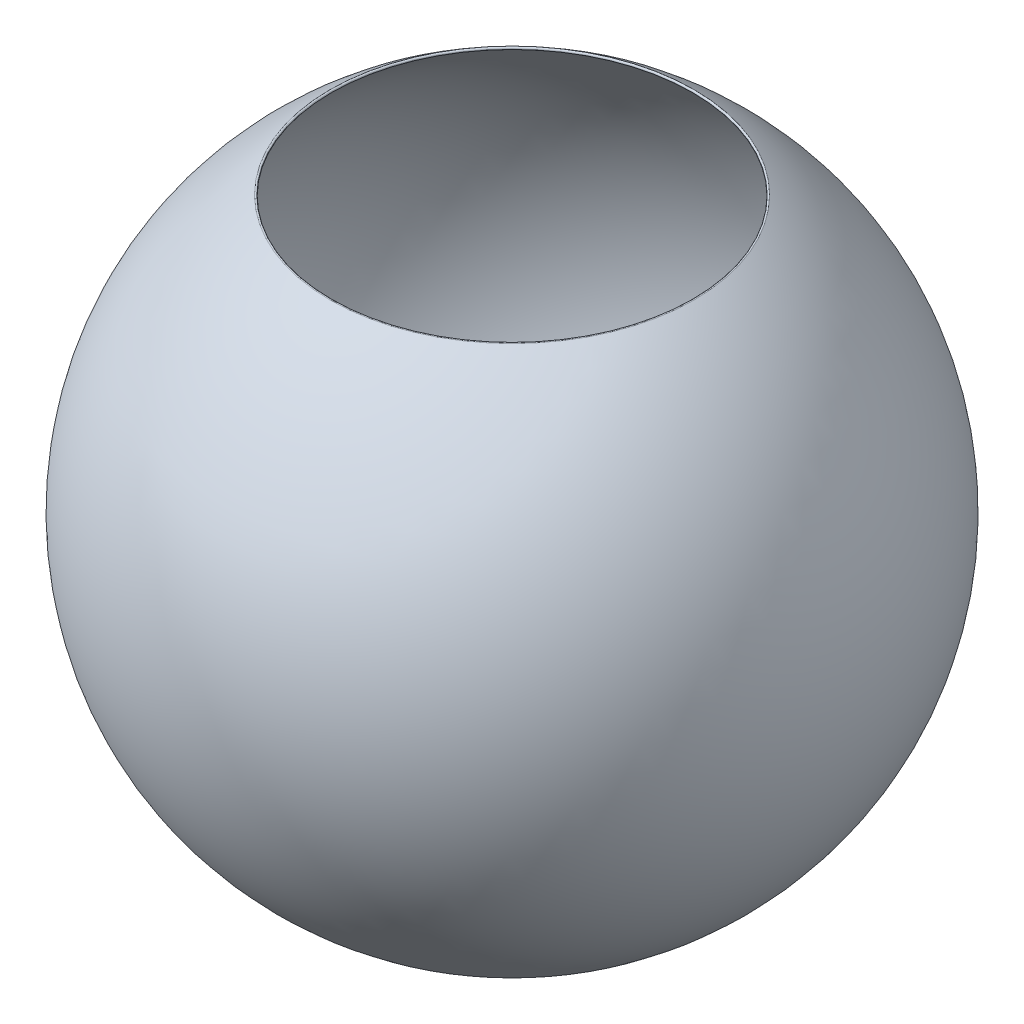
from build123d import *


with BuildPart() as part:
    # Skizze2 → Rotation2 (revolve)
    with BuildSketch(Plane.XY):
        with BuildLine():
            Line((0, -190.7), (0, -189.3))
            ThreePointArc((0, -189.3), (-181.245515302, -54.631064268), (-104.613157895, 157.767478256))
            ThreePointArc((-104.613157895, 157.767478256), (-104.416602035, 158.737718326), (-105.386842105, 158.934274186))
            ThreePointArc((-105.386842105, 158.934274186), (-182.585947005, -55.035097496), (0, -190.7))
        make_face()
    revolve(axis=Axis((0, -190, 0), (0, 1, 0)))


solid = part.part
